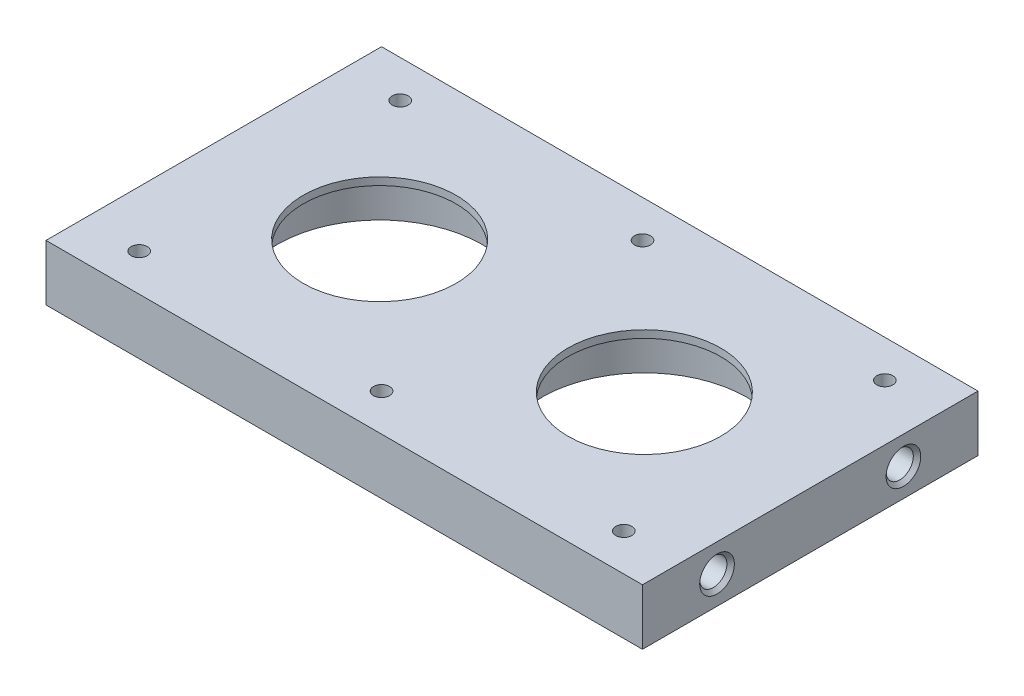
ISO-10303-21;
HEADER;
FILE_DESCRIPTION(('STEP AP214'),'2;1');
FILE_NAME('part.step','',(''),(''),'','','');
FILE_SCHEMA(('AUTOMOTIVE_DESIGN { 1 0 10303 214 1 1 1 1 }'));
ENDSEC;
DATA;
#1=APPLICATION_CONTEXT('core data for automotive mechanical design processes');
#2=APPLICATION_PROTOCOL_DEFINITION('international standard','automotive_design',2000,#1);
#3=PRODUCT_CONTEXT('',#1,'mechanical');
#4=PRODUCT('Part','Part','',(#3));
#5=PRODUCT_RELATED_PRODUCT_CATEGORY('part','',(#4));
#6=PRODUCT_DEFINITION_FORMATION('','',#4);
#7=PRODUCT_DEFINITION_CONTEXT('part definition',#1,'design');
#8=PRODUCT_DEFINITION('design','',#6,#7);
#9=PRODUCT_DEFINITION_SHAPE('','',#8);
#10=(LENGTH_UNIT() NAMED_UNIT(*) SI_UNIT(.MILLI.,.METRE.));
#11=(NAMED_UNIT(*) PLANE_ANGLE_UNIT() SI_UNIT($,.RADIAN.));
#12=(NAMED_UNIT(*) SI_UNIT($,.STERADIAN.) SOLID_ANGLE_UNIT());
#13=UNCERTAINTY_MEASURE_WITH_UNIT(LENGTH_MEASURE(1.E-05),#10,'distance_accuracy_value','');
#14=(GEOMETRIC_REPRESENTATION_CONTEXT(3) GLOBAL_UNCERTAINTY_ASSIGNED_CONTEXT((#13)) GLOBAL_UNIT_ASSIGNED_CONTEXT((#10,
#11,#12)) REPRESENTATION_CONTEXT('',''));
#15=CARTESIAN_POINT('',(0.,0.,0.));
#16=DIRECTION('',(0.,0.,1.));
#17=DIRECTION('',(1.,0.,0.));
#18=AXIS2_PLACEMENT_3D('',#15,#16,#17);
#19=CARTESIAN_POINT('',(0.,0.,0.));
#20=DIRECTION('',(0.,1.,0.));
#21=DIRECTION('',(0.,0.,1.));
#22=AXIS2_PLACEMENT_3D('',#19,#20,#21);
#23=PLANE('',#22);
#24=CARTESIAN_POINT('',(-145.,0.,-80.));
#25=DIRECTION('',(0.,-1.,0.));
#26=DIRECTION('',(0.,0.,1.));
#27=AXIS2_PLACEMENT_3D('',#24,#25,#26);
#28=CIRCLE('',#27,2.15000000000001);
#29=CARTESIAN_POINT('',(-145.,0.,-77.85));
#30=VERTEX_POINT('',#29);
#31=EDGE_CURVE('E319',#30,#30,#28,.T.);
#32=ORIENTED_EDGE('',*,*,#31,.F.);
#33=EDGE_LOOP('',(#32));
#34=FACE_BOUND('',#33,.T.);
#35=CARTESIAN_POINT('',(-80.,0.,-80.));
#36=DIRECTION('',(0.,-1.,0.));
#37=DIRECTION('',(0.,0.,1.));
#38=AXIS2_PLACEMENT_3D('',#35,#36,#37);
#39=CIRCLE('',#38,2.15);
#40=CARTESIAN_POINT('',(-80.,0.,-77.85));
#41=VERTEX_POINT('',#40);
#42=EDGE_CURVE('E311',#41,#41,#39,.T.);
#43=ORIENTED_EDGE('',*,*,#42,.F.);
#44=EDGE_LOOP('',(#43));
#45=FACE_BOUND('',#44,.T.);
#46=CARTESIAN_POINT('',(-15.,0.,-80.));
#47=DIRECTION('',(0.,-1.,0.));
#48=DIRECTION('',(0.,0.,1.));
#49=AXIS2_PLACEMENT_3D('',#46,#47,#48);
#50=CIRCLE('',#49,2.15);
#51=CARTESIAN_POINT('',(-15.,0.,-77.85));
#52=VERTEX_POINT('',#51);
#53=EDGE_CURVE('E303',#52,#52,#50,.T.);
#54=ORIENTED_EDGE('',*,*,#53,.F.);
#55=EDGE_LOOP('',(#54));
#56=FACE_BOUND('',#55,.T.);
#57=CARTESIAN_POINT('',(-15.,0.,-10.));
#58=DIRECTION('',(0.,-1.,0.));
#59=DIRECTION('',(0.,0.,-1.));
#60=AXIS2_PLACEMENT_3D('',#57,#58,#59);
#61=CIRCLE('',#60,2.15);
#62=CARTESIAN_POINT('',(-15.,0.,-12.15));
#63=VERTEX_POINT('',#62);
#64=EDGE_CURVE('E295',#63,#63,#61,.T.);
#65=ORIENTED_EDGE('',*,*,#64,.F.);
#66=EDGE_LOOP('',(#65));
#67=FACE_BOUND('',#66,.T.);
#68=CARTESIAN_POINT('',(-80.,0.,-10.));
#69=DIRECTION('',(0.,-1.,0.));
#70=DIRECTION('',(0.,0.,-1.));
#71=AXIS2_PLACEMENT_3D('',#68,#69,#70);
#72=CIRCLE('',#71,2.15);
#73=CARTESIAN_POINT('',(-80.,0.,-12.15));
#74=VERTEX_POINT('',#73);
#75=EDGE_CURVE('E287',#74,#74,#72,.T.);
#76=ORIENTED_EDGE('',*,*,#75,.F.);
#77=EDGE_LOOP('',(#76));
#78=FACE_BOUND('',#77,.T.);
#79=CARTESIAN_POINT('',(-145.,0.,-10.));
#80=DIRECTION('',(0.,-1.,0.));
#81=DIRECTION('',(0.,0.,-1.));
#82=AXIS2_PLACEMENT_3D('',#79,#80,#81);
#83=CIRCLE('',#82,2.15000000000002);
#84=CARTESIAN_POINT('',(-145.,0.,-12.15));
#85=VERTEX_POINT('',#84);
#86=EDGE_CURVE('E280',#85,#85,#83,.T.);
#87=ORIENTED_EDGE('',*,*,#86,.F.);
#88=EDGE_LOOP('',(#87));
#89=FACE_BOUND('',#88,.T.);
#90=CARTESIAN_POINT('',(-115.5,0.,-45.));
#91=DIRECTION('',(0.,1.,0.));
#92=DIRECTION('',(0.,0.,1.));
#93=AXIS2_PLACEMENT_3D('',#90,#91,#92);
#94=CIRCLE('',#93,27.55);
#95=CARTESIAN_POINT('',(-115.5,0.,-72.55));
#96=VERTEX_POINT('',#95);
#97=EDGE_CURVE('E127',#96,#96,#94,.T.);
#98=ORIENTED_EDGE('',*,*,#97,.T.);
#99=EDGE_LOOP('',(#98));
#100=FACE_BOUND('',#99,.T.);
#101=DIRECTION('',(0.,0.,-1.));
#102=VECTOR('',#101,1.);
#103=CARTESIAN_POINT('',(0.,0.,0.));
#104=LINE('',#103,#102);
#105=CARTESIAN_POINT('',(0.,0.,0.));
#106=VERTEX_POINT('',#105);
#107=CARTESIAN_POINT('',(0.,0.,-90.));
#108=VERTEX_POINT('',#107);
#109=EDGE_CURVE('E131',#106,#108,#104,.T.);
#110=ORIENTED_EDGE('',*,*,#109,.F.);
#111=DIRECTION('',(1.,0.,0.));
#112=VECTOR('',#111,1.);
#113=CARTESIAN_POINT('',(0.,0.,0.));
#114=LINE('',#113,#112);
#115=CARTESIAN_POINT('',(-160.,0.,0.));
#116=VERTEX_POINT('',#115);
#117=EDGE_CURVE('E52',#116,#106,#114,.T.);
#118=ORIENTED_EDGE('',*,*,#117,.F.);
#119=DIRECTION('',(0.,0.,1.));
#120=VECTOR('',#119,1.);
#121=CARTESIAN_POINT('',(-160.,0.,0.));
#122=LINE('',#121,#120);
#123=CARTESIAN_POINT('',(-160.,0.,-90.));
#124=VERTEX_POINT('',#123);
#125=EDGE_CURVE('E60',#124,#116,#122,.T.);
#126=ORIENTED_EDGE('',*,*,#125,.F.);
#127=DIRECTION('',(-1.,0.,0.));
#128=VECTOR('',#127,1.);
#129=CARTESIAN_POINT('',(0.,0.,-90.));
#130=LINE('',#129,#128);
#131=EDGE_CURVE('E135',#108,#124,#130,.T.);
#132=ORIENTED_EDGE('',*,*,#131,.F.);
#133=EDGE_LOOP('',(#110,#118,#126,#132));
#134=FACE_BOUND('',#133,.T.);
#135=CARTESIAN_POINT('',(-44.5,0.,-45.));
#136=DIRECTION('',(0.,1.,0.));
#137=DIRECTION('',(0.,0.,1.));
#138=AXIS2_PLACEMENT_3D('',#135,#136,#137);
#139=CIRCLE('',#138,27.55);
#140=CARTESIAN_POINT('',(-44.5,0.,-72.55));
#141=VERTEX_POINT('',#140);
#142=EDGE_CURVE('E123',#141,#141,#139,.T.);
#143=ORIENTED_EDGE('',*,*,#142,.T.);
#144=EDGE_LOOP('',(#143));
#145=FACE_BOUND('',#144,.T.);
#146=ADVANCED_FACE('F36',(#34,#45,#56,#67,#78,#89,#100,#134,#145),#23,.F.);
#147=CARTESIAN_POINT('',(0.,13.,0.));
#148=DIRECTION('',(-1.,0.,0.));
#149=DIRECTION('',(0.,0.,1.));
#150=AXIS2_PLACEMENT_3D('',#147,#148,#149);
#151=PLANE('',#150);
#152=CARTESIAN_POINT('',(0.,7.5,-20.));
#153=DIRECTION('',(-1.,0.,0.));
#154=DIRECTION('',(0.,0.,1.));
#155=AXIS2_PLACEMENT_3D('',#152,#153,#154);
#156=CIRCLE('',#155,4.65000000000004);
#157=CARTESIAN_POINT('',(0.,7.5,-15.35));
#158=VERTEX_POINT('',#157);
#159=EDGE_CURVE('E157',#158,#158,#156,.T.);
#160=ORIENTED_EDGE('',*,*,#159,.T.);
#161=EDGE_LOOP('',(#160));
#162=FACE_BOUND('',#161,.T.);
#163=CARTESIAN_POINT('',(0.,7.5,-70.));
#164=DIRECTION('',(-1.,0.,0.));
#165=DIRECTION('',(0.,0.,1.));
#166=AXIS2_PLACEMENT_3D('',#163,#164,#165);
#167=CIRCLE('',#166,4.65000000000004);
#168=CARTESIAN_POINT('',(0.,7.5,-65.3499999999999));
#169=VERTEX_POINT('',#168);
#170=EDGE_CURVE('E153',#169,#169,#167,.T.);
#171=ORIENTED_EDGE('',*,*,#170,.T.);
#172=EDGE_LOOP('',(#171));
#173=FACE_BOUND('',#172,.T.);
#174=ORIENTED_EDGE('',*,*,#109,.T.);
#175=DIRECTION('',(0.,-1.,0.));
#176=VECTOR('',#175,1.);
#177=CARTESIAN_POINT('',(0.,13.,-90.));
#178=LINE('',#177,#176);
#179=CARTESIAN_POINT('',(0.,15.,-90.));
#180=VERTEX_POINT('',#179);
#181=EDGE_CURVE('E145',#180,#108,#178,.T.);
#182=ORIENTED_EDGE('',*,*,#181,.F.);
#183=DIRECTION('',(0.,0.,-1.));
#184=VECTOR('',#183,1.);
#185=CARTESIAN_POINT('',(0.,15.,-90.));
#186=LINE('',#185,#184);
#187=CARTESIAN_POINT('',(0.,15.,0.));
#188=VERTEX_POINT('',#187);
#189=EDGE_CURVE('E93',#188,#180,#186,.T.);
#190=ORIENTED_EDGE('',*,*,#189,.F.);
#191=DIRECTION('',(0.,-1.,0.));
#192=VECTOR('',#191,1.);
#193=CARTESIAN_POINT('',(0.,13.,0.));
#194=LINE('',#193,#192);
#195=EDGE_CURVE('E84',#188,#106,#194,.T.);
#196=ORIENTED_EDGE('',*,*,#195,.T.);
#197=EDGE_LOOP('',(#174,#182,#190,#196));
#198=FACE_BOUND('',#197,.T.);
#199=ADVANCED_FACE('F232',(#162,#173,#198),#151,.F.);
#200=CARTESIAN_POINT('',(0.,13.,-90.));
#201=DIRECTION('',(0.,0.,1.));
#202=DIRECTION('',(1.,0.,0.));
#203=AXIS2_PLACEMENT_3D('',#200,#201,#202);
#204=PLANE('',#203);
#205=ORIENTED_EDGE('',*,*,#131,.T.);
#206=DIRECTION('',(0.,-1.,0.));
#207=VECTOR('',#206,1.);
#208=CARTESIAN_POINT('',(-160.,13.,-90.));
#209=LINE('',#208,#207);
#210=CARTESIAN_POINT('',(-160.,15.,-90.));
#211=VERTEX_POINT('',#210);
#212=EDGE_CURVE('E83',#211,#124,#209,.T.);
#213=ORIENTED_EDGE('',*,*,#212,.F.);
#214=DIRECTION('',(-1.,0.,0.));
#215=VECTOR('',#214,1.);
#216=CARTESIAN_POINT('',(-160.,15.,-90.));
#217=LINE('',#216,#215);
#218=EDGE_CURVE('E99',#180,#211,#217,.T.);
#219=ORIENTED_EDGE('',*,*,#218,.F.);
#220=ORIENTED_EDGE('',*,*,#181,.T.);
#221=EDGE_LOOP('',(#205,#213,#219,#220));
#222=FACE_BOUND('',#221,.T.);
#223=ADVANCED_FACE('F238',(#222),#204,.F.);
#224=CARTESIAN_POINT('',(-160.,13.,0.));
#225=DIRECTION('',(1.,0.,0.));
#226=DIRECTION('',(0.,0.,-1.));
#227=AXIS2_PLACEMENT_3D('',#224,#225,#226);
#228=PLANE('',#227);
#229=CARTESIAN_POINT('',(-160.,7.5,-20.));
#230=DIRECTION('',(1.,0.,0.));
#231=DIRECTION('',(0.,0.,-1.));
#232=AXIS2_PLACEMENT_3D('',#229,#230,#231);
#233=CIRCLE('',#232,4.64999999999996);
#234=CARTESIAN_POINT('',(-160.,7.5,-24.65));
#235=VERTEX_POINT('',#234);
#236=EDGE_CURVE('E45',#235,#235,#233,.T.);
#237=ORIENTED_EDGE('',*,*,#236,.T.);
#238=EDGE_LOOP('',(#237));
#239=FACE_BOUND('',#238,.T.);
#240=CARTESIAN_POINT('',(-160.,7.5,-70.));
#241=DIRECTION('',(1.,0.,0.));
#242=DIRECTION('',(0.,0.,-1.));
#243=AXIS2_PLACEMENT_3D('',#240,#241,#242);
#244=CIRCLE('',#243,4.64999999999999);
#245=CARTESIAN_POINT('',(-160.,7.5,-74.65));
#246=VERTEX_POINT('',#245);
#247=EDGE_CURVE('E169',#246,#246,#244,.T.);
#248=ORIENTED_EDGE('',*,*,#247,.T.);
#249=EDGE_LOOP('',(#248));
#250=FACE_BOUND('',#249,.T.);
#251=ORIENTED_EDGE('',*,*,#125,.T.);
#252=DIRECTION('',(0.,-1.,0.));
#253=VECTOR('',#252,1.);
#254=CARTESIAN_POINT('',(-160.,13.,0.));
#255=LINE('',#254,#253);
#256=CARTESIAN_POINT('',(-160.,15.,0.));
#257=VERTEX_POINT('',#256);
#258=EDGE_CURVE('E77',#257,#116,#255,.T.);
#259=ORIENTED_EDGE('',*,*,#258,.F.);
#260=DIRECTION('',(0.,0.,1.));
#261=VECTOR('',#260,1.);
#262=CARTESIAN_POINT('',(-160.,15.,-90.));
#263=LINE('',#262,#261);
#264=EDGE_CURVE('E81',#211,#257,#263,.T.);
#265=ORIENTED_EDGE('',*,*,#264,.F.);
#266=ORIENTED_EDGE('',*,*,#212,.T.);
#267=EDGE_LOOP('',(#251,#259,#265,#266));
#268=FACE_BOUND('',#267,.T.);
#269=ADVANCED_FACE('F79',(#239,#250,#268),#228,.F.);
#270=CARTESIAN_POINT('',(0.,13.,0.));
#271=DIRECTION('',(0.,0.,-1.));
#272=DIRECTION('',(-1.,0.,0.));
#273=AXIS2_PLACEMENT_3D('',#270,#271,#272);
#274=PLANE('',#273);
#275=ORIENTED_EDGE('',*,*,#117,.T.);
#276=ORIENTED_EDGE('',*,*,#195,.F.);
#277=DIRECTION('',(1.,0.,0.));
#278=VECTOR('',#277,1.);
#279=CARTESIAN_POINT('',(-160.,15.,0.));
#280=LINE('',#279,#278);
#281=EDGE_CURVE('E87',#257,#188,#280,.T.);
#282=ORIENTED_EDGE('',*,*,#281,.F.);
#283=ORIENTED_EDGE('',*,*,#258,.T.);
#284=EDGE_LOOP('',(#275,#276,#282,#283));
#285=FACE_BOUND('',#284,.T.);
#286=ADVANCED_FACE('F88',(#285),#274,.F.);
#287=CARTESIAN_POINT('',(-115.5,13.,-45.));
#288=DIRECTION('',(0.,-1.,0.));
#289=DIRECTION('',(0.,0.,-1.));
#290=AXIS2_PLACEMENT_3D('',#287,#288,#289);
#291=CYLINDRICAL_SURFACE('',#290,27.55);
#292=CARTESIAN_POINT('',(-115.5,13.,-45.));
#293=DIRECTION('',(0.,1.,0.));
#294=DIRECTION('',(0.,0.,1.));
#295=AXIS2_PLACEMENT_3D('',#292,#293,#294);
#296=CIRCLE('',#295,27.55);
#297=CARTESIAN_POINT('',(-115.5,13.,-72.55));
#298=VERTEX_POINT('',#297);
#299=EDGE_CURVE('E119',#298,#298,#296,.T.);
#300=CARTESIAN_POINT('',(-115.5,13.,-72.55));
#301=CARTESIAN_POINT('',(-115.5,12.8645833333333,-72.55));
#302=CARTESIAN_POINT('',(-115.5,12.7291666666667,-72.55));
#303=CARTESIAN_POINT('',(-115.5,12.4583333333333,-72.55));
#304=CARTESIAN_POINT('',(-115.5,12.3229166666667,-72.55));
#305=CARTESIAN_POINT('',(-115.5,12.0520833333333,-72.55));
#306=CARTESIAN_POINT('',(-115.5,11.9166666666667,-72.55));
#307=CARTESIAN_POINT('',(-115.5,11.6458333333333,-72.55));
#308=CARTESIAN_POINT('',(-115.5,11.5104166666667,-72.55));
#309=CARTESIAN_POINT('',(-115.5,11.2395833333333,-72.55));
#310=CARTESIAN_POINT('',(-115.5,11.1041666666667,-72.55));
#311=CARTESIAN_POINT('',(-115.5,10.8333333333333,-72.55));
#312=CARTESIAN_POINT('',(-115.5,10.6979166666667,-72.55));
#313=CARTESIAN_POINT('',(-115.5,10.4270833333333,-72.55));
#314=CARTESIAN_POINT('',(-115.5,10.2916666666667,-72.55));
#315=CARTESIAN_POINT('',(-115.5,10.0208333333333,-72.55));
#316=CARTESIAN_POINT('',(-115.5,9.88541666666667,-72.55));
#317=CARTESIAN_POINT('',(-115.5,9.61458333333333,-72.55));
#318=CARTESIAN_POINT('',(-115.5,9.47916666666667,-72.55));
#319=CARTESIAN_POINT('',(-115.5,9.20833333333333,-72.55));
#320=CARTESIAN_POINT('',(-115.5,9.07291666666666,-72.55));
#321=CARTESIAN_POINT('',(-115.5,8.80208333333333,-72.55));
#322=CARTESIAN_POINT('',(-115.5,8.66666666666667,-72.55));
#323=CARTESIAN_POINT('',(-115.5,8.39583333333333,-72.55));
#324=CARTESIAN_POINT('',(-115.5,8.26041666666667,-72.55));
#325=CARTESIAN_POINT('',(-115.5,7.98958333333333,-72.55));
#326=CARTESIAN_POINT('',(-115.5,7.85416666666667,-72.55));
#327=CARTESIAN_POINT('',(-115.5,7.58333333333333,-72.55));
#328=CARTESIAN_POINT('',(-115.5,7.44791666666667,-72.55));
#329=CARTESIAN_POINT('',(-115.5,7.17708333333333,-72.55));
#330=CARTESIAN_POINT('',(-115.5,7.04166666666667,-72.55));
#331=CARTESIAN_POINT('',(-115.5,6.77083333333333,-72.55));
#332=CARTESIAN_POINT('',(-115.5,6.63541666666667,-72.55));
#333=CARTESIAN_POINT('',(-115.5,6.36458333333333,-72.55));
#334=CARTESIAN_POINT('',(-115.5,6.22916666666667,-72.55));
#335=CARTESIAN_POINT('',(-115.5,5.95833333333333,-72.55));
#336=CARTESIAN_POINT('',(-115.5,5.82291666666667,-72.55));
#337=CARTESIAN_POINT('',(-115.5,5.55208333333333,-72.55));
#338=CARTESIAN_POINT('',(-115.5,5.41666666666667,-72.55));
#339=CARTESIAN_POINT('',(-115.5,5.14583333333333,-72.55));
#340=CARTESIAN_POINT('',(-115.5,5.01041666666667,-72.55));
#341=CARTESIAN_POINT('',(-115.5,4.73958333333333,-72.55));
#342=CARTESIAN_POINT('',(-115.5,4.60416666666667,-72.55));
#343=CARTESIAN_POINT('',(-115.5,4.33333333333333,-72.55));
#344=CARTESIAN_POINT('',(-115.5,4.19791666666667,-72.55));
#345=CARTESIAN_POINT('',(-115.5,3.92708333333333,-72.55));
#346=CARTESIAN_POINT('',(-115.5,3.79166666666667,-72.55));
#347=CARTESIAN_POINT('',(-115.5,3.52083333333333,-72.55));
#348=CARTESIAN_POINT('',(-115.5,3.38541666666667,-72.55));
#349=CARTESIAN_POINT('',(-115.5,3.11458333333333,-72.55));
#350=CARTESIAN_POINT('',(-115.5,2.97916666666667,-72.55));
#351=CARTESIAN_POINT('',(-115.5,2.70833333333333,-72.55));
#352=CARTESIAN_POINT('',(-115.5,2.57291666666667,-72.55));
#353=CARTESIAN_POINT('',(-115.5,2.30208333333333,-72.55));
#354=CARTESIAN_POINT('',(-115.5,2.16666666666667,-72.55));
#355=CARTESIAN_POINT('',(-115.5,1.89583333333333,-72.55));
#356=CARTESIAN_POINT('',(-115.5,1.76041666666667,-72.55));
#357=CARTESIAN_POINT('',(-115.5,1.48958333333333,-72.55));
#358=CARTESIAN_POINT('',(-115.5,1.35416666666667,-72.55));
#359=CARTESIAN_POINT('',(-115.5,1.08333333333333,-72.55));
#360=CARTESIAN_POINT('',(-115.5,0.947916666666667,-72.55));
#361=CARTESIAN_POINT('',(-115.5,0.677083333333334,-72.55));
#362=CARTESIAN_POINT('',(-115.5,0.541666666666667,-72.55));
#363=CARTESIAN_POINT('',(-115.5,0.270833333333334,-72.55));
#364=CARTESIAN_POINT('',(-115.5,0.135416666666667,-72.55));
#365=CARTESIAN_POINT('',(-115.5,0.,-72.55));
#366=B_SPLINE_CURVE_WITH_KNOTS('',3,(#300,#301,#302,#303,#304,#305,#306,#307,#308,#309,#310,
#311,#312,#313,#314,#315,#316,#317,#318,#319,#320,#321,#322,#323,#324,#325,#326,#327,#328,#329,
#330,#331,#332,#333,#334,#335,#336,#337,#338,#339,#340,#341,#342,#343,#344,#345,#346,#347,#348,
#349,#350,#351,#352,#353,#354,#355,#356,#357,#358,#359,#360,#361,#362,#363,#364,#365),
.UNSPECIFIED.,.F.,.F.,(4,2,2,2,2,2,2,2,2,2,2,2,2,2,2,2,2,2,2,2,2,2,2,2,2,2,2,2,2,2,2,2,4),(0.,
0.40625,0.812500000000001,1.21875,1.625,2.03125,2.4375,2.84375,3.25,3.65625,4.0625,4.46875,
4.875,5.28125,5.6875,6.09375,6.5,6.90625,7.3125,7.71875,8.125,8.53125,8.9375,9.34375,9.75,
10.15625,10.5625,10.96875,11.375,11.78125,12.1875,12.59375,13.),.UNSPECIFIED.);
#367=EDGE_CURVE('BSEAM245',#298,#96,#366,.T.);
#368=ORIENTED_EDGE('',*,*,#299,.T.);
#369=ORIENTED_EDGE('',*,*,#97,.F.);
#370=ORIENTED_EDGE('',*,*,#367,.T.);
#371=ORIENTED_EDGE('',*,*,#367,.F.);
#372=EDGE_LOOP('',(#368,#370,#369,#371));
#373=FACE_BOUND('',#372,.T.);
#374=ADVANCED_FACE('F245',(#373),#291,.F.);
#375=CARTESIAN_POINT('',(-44.5,13.,-45.));
#376=DIRECTION('',(0.,-1.,0.));
#377=DIRECTION('',(0.,0.,-1.));
#378=AXIS2_PLACEMENT_3D('',#375,#376,#377);
#379=CYLINDRICAL_SURFACE('',#378,27.55);
#380=CARTESIAN_POINT('',(-44.5,13.,-45.));
#381=DIRECTION('',(0.,1.,0.));
#382=DIRECTION('',(0.,0.,1.));
#383=AXIS2_PLACEMENT_3D('',#380,#381,#382);
#384=CIRCLE('',#383,27.55);
#385=CARTESIAN_POINT('',(-44.5,13.,-72.55));
#386=VERTEX_POINT('',#385);
#387=EDGE_CURVE('E115',#386,#386,#384,.T.);
#388=CARTESIAN_POINT('',(-44.5,13.,-72.55));
#389=CARTESIAN_POINT('',(-44.5,12.8645833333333,-72.55));
#390=CARTESIAN_POINT('',(-44.5,12.7291666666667,-72.55));
#391=CARTESIAN_POINT('',(-44.5,12.4583333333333,-72.55));
#392=CARTESIAN_POINT('',(-44.5,12.3229166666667,-72.55));
#393=CARTESIAN_POINT('',(-44.5,12.0520833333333,-72.55));
#394=CARTESIAN_POINT('',(-44.5,11.9166666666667,-72.55));
#395=CARTESIAN_POINT('',(-44.5,11.6458333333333,-72.55));
#396=CARTESIAN_POINT('',(-44.5,11.5104166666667,-72.55));
#397=CARTESIAN_POINT('',(-44.5,11.2395833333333,-72.55));
#398=CARTESIAN_POINT('',(-44.5,11.1041666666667,-72.55));
#399=CARTESIAN_POINT('',(-44.5,10.8333333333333,-72.55));
#400=CARTESIAN_POINT('',(-44.5,10.6979166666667,-72.55));
#401=CARTESIAN_POINT('',(-44.5,10.4270833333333,-72.55));
#402=CARTESIAN_POINT('',(-44.5,10.2916666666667,-72.55));
#403=CARTESIAN_POINT('',(-44.5,10.0208333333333,-72.55));
#404=CARTESIAN_POINT('',(-44.5,9.88541666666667,-72.55));
#405=CARTESIAN_POINT('',(-44.5,9.61458333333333,-72.55));
#406=CARTESIAN_POINT('',(-44.5,9.47916666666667,-72.55));
#407=CARTESIAN_POINT('',(-44.5,9.20833333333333,-72.55));
#408=CARTESIAN_POINT('',(-44.5,9.07291666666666,-72.55));
#409=CARTESIAN_POINT('',(-44.5,8.80208333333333,-72.55));
#410=CARTESIAN_POINT('',(-44.5,8.66666666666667,-72.55));
#411=CARTESIAN_POINT('',(-44.5,8.39583333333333,-72.55));
#412=CARTESIAN_POINT('',(-44.5,8.26041666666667,-72.55));
#413=CARTESIAN_POINT('',(-44.5,7.98958333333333,-72.55));
#414=CARTESIAN_POINT('',(-44.5,7.85416666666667,-72.55));
#415=CARTESIAN_POINT('',(-44.5,7.58333333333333,-72.55));
#416=CARTESIAN_POINT('',(-44.5,7.44791666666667,-72.55));
#417=CARTESIAN_POINT('',(-44.5,7.17708333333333,-72.55));
#418=CARTESIAN_POINT('',(-44.5,7.04166666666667,-72.55));
#419=CARTESIAN_POINT('',(-44.5,6.77083333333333,-72.55));
#420=CARTESIAN_POINT('',(-44.5,6.63541666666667,-72.55));
#421=CARTESIAN_POINT('',(-44.5,6.36458333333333,-72.55));
#422=CARTESIAN_POINT('',(-44.5,6.22916666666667,-72.55));
#423=CARTESIAN_POINT('',(-44.5,5.95833333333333,-72.55));
#424=CARTESIAN_POINT('',(-44.5,5.82291666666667,-72.55));
#425=CARTESIAN_POINT('',(-44.5,5.55208333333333,-72.55));
#426=CARTESIAN_POINT('',(-44.5,5.41666666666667,-72.55));
#427=CARTESIAN_POINT('',(-44.5,5.14583333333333,-72.55));
#428=CARTESIAN_POINT('',(-44.5,5.01041666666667,-72.55));
#429=CARTESIAN_POINT('',(-44.5,4.73958333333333,-72.55));
#430=CARTESIAN_POINT('',(-44.5,4.60416666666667,-72.55));
#431=CARTESIAN_POINT('',(-44.5,4.33333333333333,-72.55));
#432=CARTESIAN_POINT('',(-44.5,4.19791666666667,-72.55));
#433=CARTESIAN_POINT('',(-44.5,3.92708333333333,-72.55));
#434=CARTESIAN_POINT('',(-44.5,3.79166666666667,-72.55));
#435=CARTESIAN_POINT('',(-44.5,3.52083333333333,-72.55));
#436=CARTESIAN_POINT('',(-44.5,3.38541666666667,-72.55));
#437=CARTESIAN_POINT('',(-44.5,3.11458333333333,-72.55));
#438=CARTESIAN_POINT('',(-44.5,2.97916666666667,-72.55));
#439=CARTESIAN_POINT('',(-44.5,2.70833333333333,-72.55));
#440=CARTESIAN_POINT('',(-44.5,2.57291666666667,-72.55));
#441=CARTESIAN_POINT('',(-44.5,2.30208333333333,-72.55));
#442=CARTESIAN_POINT('',(-44.5,2.16666666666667,-72.55));
#443=CARTESIAN_POINT('',(-44.5,1.89583333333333,-72.55));
#444=CARTESIAN_POINT('',(-44.5,1.76041666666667,-72.55));
#445=CARTESIAN_POINT('',(-44.5,1.48958333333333,-72.55));
#446=CARTESIAN_POINT('',(-44.5,1.35416666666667,-72.55));
#447=CARTESIAN_POINT('',(-44.5,1.08333333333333,-72.55));
#448=CARTESIAN_POINT('',(-44.5,0.947916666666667,-72.55));
#449=CARTESIAN_POINT('',(-44.5,0.677083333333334,-72.55));
#450=CARTESIAN_POINT('',(-44.5,0.541666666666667,-72.55));
#451=CARTESIAN_POINT('',(-44.5,0.270833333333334,-72.55));
#452=CARTESIAN_POINT('',(-44.5,0.135416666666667,-72.55));
#453=CARTESIAN_POINT('',(-44.5,0.,-72.55));
#454=B_SPLINE_CURVE_WITH_KNOTS('',3,(#388,#389,#390,#391,#392,#393,#394,#395,#396,#397,#398,
#399,#400,#401,#402,#403,#404,#405,#406,#407,#408,#409,#410,#411,#412,#413,#414,#415,#416,#417,
#418,#419,#420,#421,#422,#423,#424,#425,#426,#427,#428,#429,#430,#431,#432,#433,#434,#435,#436,
#437,#438,#439,#440,#441,#442,#443,#444,#445,#446,#447,#448,#449,#450,#451,#452,#453),
.UNSPECIFIED.,.F.,.F.,(4,2,2,2,2,2,2,2,2,2,2,2,2,2,2,2,2,2,2,2,2,2,2,2,2,2,2,2,2,2,2,2,4),(0.,
0.40625,0.812500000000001,1.21875,1.625,2.03125,2.4375,2.84375,3.25,3.65625,4.0625,4.46875,
4.875,5.28125,5.6875,6.09375,6.5,6.90625,7.3125,7.71875,8.125,8.53125,8.9375,9.34375,9.75,
10.15625,10.5625,10.96875,11.375,11.78125,12.1875,12.59375,13.),.UNSPECIFIED.);
#455=EDGE_CURVE('BSEAM533',#386,#141,#454,.T.);
#456=ORIENTED_EDGE('',*,*,#387,.T.);
#457=ORIENTED_EDGE('',*,*,#142,.F.);
#458=ORIENTED_EDGE('',*,*,#455,.T.);
#459=ORIENTED_EDGE('',*,*,#455,.F.);
#460=EDGE_LOOP('',(#456,#458,#457,#459));
#461=FACE_BOUND('',#460,.T.);
#462=ADVANCED_FACE('F533',(#461),#379,.F.);
#463=CARTESIAN_POINT('',(0.,13.,0.));
#464=DIRECTION('',(0.,1.,0.));
#465=DIRECTION('',(0.,0.,1.));
#466=AXIS2_PLACEMENT_3D('',#463,#464,#465);
#467=PLANE('',#466);
#468=ORIENTED_EDGE('',*,*,#299,.F.);
#469=EDGE_LOOP('',(#468));
#470=FACE_BOUND('',#469,.T.);
#471=CARTESIAN_POINT('',(-115.5,13.,-45.));
#472=DIRECTION('',(0.,1.,0.));
#473=DIRECTION('',(0.,0.,1.));
#474=AXIS2_PLACEMENT_3D('',#471,#472,#473);
#475=CIRCLE('',#474,20.5);
#476=CARTESIAN_POINT('',(-115.5,13.,-24.5));
#477=VERTEX_POINT('',#476);
#478=EDGE_CURVE('E107',#477,#477,#475,.T.);
#479=ORIENTED_EDGE('',*,*,#478,.T.);
#480=EDGE_LOOP('',(#479));
#481=FACE_BOUND('',#480,.T.);
#482=ADVANCED_FACE('F518',(#470,#481),#467,.F.);
#483=CARTESIAN_POINT('',(0.,15.,0.));
#484=DIRECTION('',(0.,1.,0.));
#485=DIRECTION('',(0.,0.,1.));
#486=AXIS2_PLACEMENT_3D('',#483,#484,#485);
#487=PLANE('',#486);
#488=CARTESIAN_POINT('',(-145.,15.,-80.));
#489=DIRECTION('',(0.,-1.,0.));
#490=DIRECTION('',(0.,0.,1.));
#491=AXIS2_PLACEMENT_3D('',#488,#489,#490);
#492=CIRCLE('',#491,2.15000000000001);
#493=CARTESIAN_POINT('',(-145.,15.,-77.85));
#494=VERTEX_POINT('',#493);
#495=EDGE_CURVE('E315',#494,#494,#492,.T.);
#496=ORIENTED_EDGE('',*,*,#495,.T.);
#497=EDGE_LOOP('',(#496));
#498=FACE_BOUND('',#497,.T.);
#499=CARTESIAN_POINT('',(-80.,15.,-80.));
#500=DIRECTION('',(0.,-1.,0.));
#501=DIRECTION('',(0.,0.,1.));
#502=AXIS2_PLACEMENT_3D('',#499,#500,#501);
#503=CIRCLE('',#502,2.15);
#504=CARTESIAN_POINT('',(-80.,15.,-77.85));
#505=VERTEX_POINT('',#504);
#506=EDGE_CURVE('E307',#505,#505,#503,.T.);
#507=ORIENTED_EDGE('',*,*,#506,.T.);
#508=EDGE_LOOP('',(#507));
#509=FACE_BOUND('',#508,.T.);
#510=CARTESIAN_POINT('',(-15.,15.,-80.));
#511=DIRECTION('',(0.,-1.,0.));
#512=DIRECTION('',(0.,0.,1.));
#513=AXIS2_PLACEMENT_3D('',#510,#511,#512);
#514=CIRCLE('',#513,2.15);
#515=CARTESIAN_POINT('',(-15.,15.,-77.85));
#516=VERTEX_POINT('',#515);
#517=EDGE_CURVE('E299',#516,#516,#514,.T.);
#518=ORIENTED_EDGE('',*,*,#517,.T.);
#519=EDGE_LOOP('',(#518));
#520=FACE_BOUND('',#519,.T.);
#521=CARTESIAN_POINT('',(-15.,15.,-10.));
#522=DIRECTION('',(0.,-1.,0.));
#523=DIRECTION('',(0.,0.,-1.));
#524=AXIS2_PLACEMENT_3D('',#521,#522,#523);
#525=CIRCLE('',#524,2.15);
#526=CARTESIAN_POINT('',(-15.,15.,-12.15));
#527=VERTEX_POINT('',#526);
#528=EDGE_CURVE('E291',#527,#527,#525,.T.);
#529=ORIENTED_EDGE('',*,*,#528,.T.);
#530=EDGE_LOOP('',(#529));
#531=FACE_BOUND('',#530,.T.);
#532=CARTESIAN_POINT('',(-80.,15.,-10.));
#533=DIRECTION('',(0.,-1.,0.));
#534=DIRECTION('',(0.,0.,-1.));
#535=AXIS2_PLACEMENT_3D('',#532,#533,#534);
#536=CIRCLE('',#535,2.15);
#537=CARTESIAN_POINT('',(-80.,15.,-12.15));
#538=VERTEX_POINT('',#537);
#539=EDGE_CURVE('E285',#538,#538,#536,.T.);
#540=ORIENTED_EDGE('',*,*,#539,.T.);
#541=EDGE_LOOP('',(#540));
#542=FACE_BOUND('',#541,.T.);
#543=CARTESIAN_POINT('',(-145.,15.,-10.));
#544=DIRECTION('',(0.,-1.,0.));
#545=DIRECTION('',(0.,0.,-1.));
#546=AXIS2_PLACEMENT_3D('',#543,#544,#545);
#547=CIRCLE('',#546,2.15000000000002);
#548=CARTESIAN_POINT('',(-145.,15.,-12.15));
#549=VERTEX_POINT('',#548);
#550=EDGE_CURVE('E276',#549,#549,#547,.T.);
#551=ORIENTED_EDGE('',*,*,#550,.T.);
#552=EDGE_LOOP('',(#551));
#553=FACE_BOUND('',#552,.T.);
#554=CARTESIAN_POINT('',(-115.5,15.,-45.));
#555=DIRECTION('',(0.,1.,0.));
#556=DIRECTION('',(0.,0.,1.));
#557=AXIS2_PLACEMENT_3D('',#554,#555,#556);
#558=CIRCLE('',#557,20.5);
#559=CARTESIAN_POINT('',(-115.5,15.,-24.5));
#560=VERTEX_POINT('',#559);
#561=EDGE_CURVE('E101',#560,#560,#558,.T.);
#562=ORIENTED_EDGE('',*,*,#561,.F.);
#563=EDGE_LOOP('',(#562));
#564=FACE_BOUND('',#563,.T.);
#565=ORIENTED_EDGE('',*,*,#264,.T.);
#566=ORIENTED_EDGE('',*,*,#281,.T.);
#567=ORIENTED_EDGE('',*,*,#189,.T.);
#568=ORIENTED_EDGE('',*,*,#218,.T.);
#569=EDGE_LOOP('',(#565,#566,#567,#568));
#570=FACE_BOUND('',#569,.T.);
#571=CARTESIAN_POINT('',(-44.5,15.,-45.));
#572=DIRECTION('',(0.,1.,0.));
#573=DIRECTION('',(0.,0.,1.));
#574=AXIS2_PLACEMENT_3D('',#571,#572,#573);
#575=CIRCLE('',#574,20.5);
#576=CARTESIAN_POINT('',(-44.5,15.,-24.5));
#577=VERTEX_POINT('',#576);
#578=EDGE_CURVE('E207',#577,#577,#575,.T.);
#579=ORIENTED_EDGE('',*,*,#578,.F.);
#580=EDGE_LOOP('',(#579));
#581=FACE_BOUND('',#580,.T.);
#582=ADVANCED_FACE('F96',(#498,#509,#520,#531,#542,#553,#564,#570,#581),#487,.T.);
#583=ORIENTED_EDGE('',*,*,#387,.F.);
#584=EDGE_LOOP('',(#583));
#585=FACE_BOUND('',#584,.T.);
#586=CARTESIAN_POINT('',(-44.5,13.,-45.));
#587=DIRECTION('',(0.,1.,0.));
#588=DIRECTION('',(0.,0.,1.));
#589=AXIS2_PLACEMENT_3D('',#586,#587,#588);
#590=CIRCLE('',#589,20.5);
#591=CARTESIAN_POINT('',(-44.5,13.,-24.5));
#592=VERTEX_POINT('',#591);
#593=EDGE_CURVE('E199',#592,#592,#590,.T.);
#594=ORIENTED_EDGE('',*,*,#593,.T.);
#595=EDGE_LOOP('',(#594));
#596=FACE_BOUND('',#595,.T.);
#597=ADVANCED_FACE('F215',(#585,#596),#467,.F.);
#598=CARTESIAN_POINT('',(-115.5,15.,-45.));
#599=DIRECTION('',(0.,-1.,0.));
#600=DIRECTION('',(0.,0.,-1.));
#601=AXIS2_PLACEMENT_3D('',#598,#599,#600);
#602=CYLINDRICAL_SURFACE('',#601,20.5);
#603=ORIENTED_EDGE('',*,*,#561,.T.);
#604=EDGE_LOOP('',(#603));
#605=FACE_BOUND('',#604,.T.);
#606=ORIENTED_EDGE('',*,*,#478,.F.);
#607=EDGE_LOOP('',(#606));
#608=FACE_BOUND('',#607,.T.);
#609=ADVANCED_FACE('F220',(#605,#608),#602,.F.);
#610=CARTESIAN_POINT('',(-44.5,15.,-45.));
#611=DIRECTION('',(0.,-1.,0.));
#612=DIRECTION('',(0.,0.,-1.));
#613=AXIS2_PLACEMENT_3D('',#610,#611,#612);
#614=CYLINDRICAL_SURFACE('',#613,20.5);
#615=ORIENTED_EDGE('',*,*,#578,.T.);
#616=EDGE_LOOP('',(#615));
#617=FACE_BOUND('',#616,.T.);
#618=ORIENTED_EDGE('',*,*,#593,.F.);
#619=EDGE_LOOP('',(#618));
#620=FACE_BOUND('',#619,.T.);
#621=ADVANCED_FACE('F217',(#617,#620),#614,.F.);
#622=CARTESIAN_POINT('',(-140.,7.5,-70.));
#623=DIRECTION('',(-1.,0.,0.));
#624=DIRECTION('',(0.,0.,1.));
#625=AXIS2_PLACEMENT_3D('',#622,#623,#624);
#626=CYLINDRICAL_SURFACE('',#625,3.65);
#627=CARTESIAN_POINT('',(-159.,7.5,-70.));
#628=DIRECTION('',(1.,0.,0.));
#629=DIRECTION('',(0.,0.,-1.));
#630=AXIS2_PLACEMENT_3D('',#627,#628,#629);
#631=CIRCLE('',#630,3.65);
#632=CARTESIAN_POINT('',(-159.,7.5,-73.65));
#633=VERTEX_POINT('',#632);
#634=EDGE_CURVE('E11',#633,#633,#631,.F.);
#635=ORIENTED_EDGE('',*,*,#634,.T.);
#636=EDGE_LOOP('',(#635));
#637=FACE_BOUND('',#636,.T.);
#638=CARTESIAN_POINT('',(-140.,7.5,-70.));
#639=DIRECTION('',(-1.,0.,0.));
#640=DIRECTION('',(0.,0.,1.));
#641=AXIS2_PLACEMENT_3D('',#638,#639,#640);
#642=CIRCLE('',#641,3.65);
#643=CARTESIAN_POINT('',(-140.,7.5,-66.35));
#644=VERTEX_POINT('',#643);
#645=EDGE_CURVE('E195',#644,#644,#642,.T.);
#646=ORIENTED_EDGE('',*,*,#645,.F.);
#647=EDGE_LOOP('',(#646));
#648=FACE_BOUND('',#647,.T.);
#649=ADVANCED_FACE('F219',(#637,#648),#626,.F.);
#650=CARTESIAN_POINT('',(-140.,7.5,-70.));
#651=DIRECTION('',(-1.,0.,0.));
#652=DIRECTION('',(0.,0.,1.));
#653=AXIS2_PLACEMENT_3D('',#650,#651,#652);
#654=PLANE('',#653);
#655=ORIENTED_EDGE('',*,*,#645,.T.);
#656=EDGE_LOOP('',(#655));
#657=FACE_BOUND('',#656,.T.);
#658=ADVANCED_FACE('F189',(#657),#654,.T.);
#659=CARTESIAN_POINT('',(-140.,7.5,-20.));
#660=DIRECTION('',(-1.,0.,0.));
#661=DIRECTION('',(0.,0.,1.));
#662=AXIS2_PLACEMENT_3D('',#659,#660,#661);
#663=CYLINDRICAL_SURFACE('',#662,3.65);
#664=CARTESIAN_POINT('',(-159.,7.5,-20.));
#665=DIRECTION('',(1.,0.,0.));
#666=DIRECTION('',(0.,0.,-1.));
#667=AXIS2_PLACEMENT_3D('',#664,#665,#666);
#668=CIRCLE('',#667,3.65);
#669=CARTESIAN_POINT('',(-159.,7.5,-23.65));
#670=VERTEX_POINT('',#669);
#671=EDGE_CURVE('E165',#670,#670,#668,.F.);
#672=ORIENTED_EDGE('',*,*,#671,.T.);
#673=EDGE_LOOP('',(#672));
#674=FACE_BOUND('',#673,.T.);
#675=CARTESIAN_POINT('',(-140.,7.5,-20.));
#676=DIRECTION('',(-1.,0.,0.));
#677=DIRECTION('',(0.,0.,1.));
#678=AXIS2_PLACEMENT_3D('',#675,#676,#677);
#679=CIRCLE('',#678,3.65);
#680=CARTESIAN_POINT('',(-140.,7.5,-16.35));
#681=VERTEX_POINT('',#680);
#682=EDGE_CURVE('E193',#681,#681,#679,.T.);
#683=ORIENTED_EDGE('',*,*,#682,.F.);
#684=EDGE_LOOP('',(#683));
#685=FACE_BOUND('',#684,.T.);
#686=ADVANCED_FACE('F185',(#674,#685),#663,.F.);
#687=CARTESIAN_POINT('',(-140.,7.5,-20.));
#688=DIRECTION('',(-1.,0.,0.));
#689=DIRECTION('',(0.,0.,1.));
#690=AXIS2_PLACEMENT_3D('',#687,#688,#689);
#691=PLANE('',#690);
#692=ORIENTED_EDGE('',*,*,#682,.T.);
#693=EDGE_LOOP('',(#692));
#694=FACE_BOUND('',#693,.T.);
#695=ADVANCED_FACE('F188',(#694),#691,.T.);
#696=CARTESIAN_POINT('',(-20.,7.5,-20.));
#697=DIRECTION('',(1.,0.,0.));
#698=DIRECTION('',(0.,0.,-1.));
#699=AXIS2_PLACEMENT_3D('',#696,#697,#698);
#700=CYLINDRICAL_SURFACE('',#699,3.65);
#701=CARTESIAN_POINT('',(-1.00000000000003,7.5,-20.));
#702=DIRECTION('',(-1.,0.,0.));
#703=DIRECTION('',(0.,0.,1.));
#704=AXIS2_PLACEMENT_3D('',#701,#702,#703);
#705=CIRCLE('',#704,3.65);
#706=CARTESIAN_POINT('',(-1.00000000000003,7.5,-16.35));
#707=VERTEX_POINT('',#706);
#708=EDGE_CURVE('E149',#707,#707,#705,.F.);
#709=ORIENTED_EDGE('',*,*,#708,.T.);
#710=EDGE_LOOP('',(#709));
#711=FACE_BOUND('',#710,.T.);
#712=CARTESIAN_POINT('',(-20.,7.5,-20.));
#713=DIRECTION('',(1.,0.,0.));
#714=DIRECTION('',(0.,0.,-1.));
#715=AXIS2_PLACEMENT_3D('',#712,#713,#714);
#716=CIRCLE('',#715,3.65);
#717=CARTESIAN_POINT('',(-20.,7.5,-23.65));
#718=VERTEX_POINT('',#717);
#719=EDGE_CURVE('E196',#718,#718,#716,.T.);
#720=ORIENTED_EDGE('',*,*,#719,.F.);
#721=EDGE_LOOP('',(#720));
#722=FACE_BOUND('',#721,.T.);
#723=ADVANCED_FACE('F360',(#711,#722),#700,.F.);
#724=CARTESIAN_POINT('',(-20.,7.5,-20.));
#725=DIRECTION('',(1.,0.,0.));
#726=DIRECTION('',(0.,0.,-1.));
#727=AXIS2_PLACEMENT_3D('',#724,#725,#726);
#728=PLANE('',#727);
#729=ORIENTED_EDGE('',*,*,#719,.T.);
#730=EDGE_LOOP('',(#729));
#731=FACE_BOUND('',#730,.T.);
#732=ADVANCED_FACE('F270',(#731),#728,.T.);
#733=CARTESIAN_POINT('',(-20.,7.5,-70.));
#734=DIRECTION('',(1.,0.,0.));
#735=DIRECTION('',(0.,0.,-1.));
#736=AXIS2_PLACEMENT_3D('',#733,#734,#735);
#737=CYLINDRICAL_SURFACE('',#736,3.65);
#738=CARTESIAN_POINT('',(-1.00000000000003,7.5,-70.));
#739=DIRECTION('',(-1.,0.,0.));
#740=DIRECTION('',(0.,0.,1.));
#741=AXIS2_PLACEMENT_3D('',#738,#739,#740);
#742=CIRCLE('',#741,3.65);
#743=CARTESIAN_POINT('',(-1.00000000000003,7.5,-66.35));
#744=VERTEX_POINT('',#743);
#745=EDGE_CURVE('E161',#744,#744,#742,.F.);
#746=ORIENTED_EDGE('',*,*,#745,.T.);
#747=EDGE_LOOP('',(#746));
#748=FACE_BOUND('',#747,.T.);
#749=CARTESIAN_POINT('',(-20.,7.5,-70.));
#750=DIRECTION('',(1.,0.,0.));
#751=DIRECTION('',(0.,0.,-1.));
#752=AXIS2_PLACEMENT_3D('',#749,#750,#751);
#753=CIRCLE('',#752,3.65);
#754=CARTESIAN_POINT('',(-20.,7.5,-73.65));
#755=VERTEX_POINT('',#754);
#756=EDGE_CURVE('E203',#755,#755,#753,.T.);
#757=ORIENTED_EDGE('',*,*,#756,.F.);
#758=EDGE_LOOP('',(#757));
#759=FACE_BOUND('',#758,.T.);
#760=ADVANCED_FACE('F267',(#748,#759),#737,.F.);
#761=CARTESIAN_POINT('',(-20.,7.5,-70.));
#762=DIRECTION('',(1.,0.,0.));
#763=DIRECTION('',(0.,0.,-1.));
#764=AXIS2_PLACEMENT_3D('',#761,#762,#763);
#765=PLANE('',#764);
#766=ORIENTED_EDGE('',*,*,#756,.T.);
#767=EDGE_LOOP('',(#766));
#768=FACE_BOUND('',#767,.T.);
#769=ADVANCED_FACE('F257',(#768),#765,.T.);
#770=CARTESIAN_POINT('',(-1.00000000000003,7.5,-20.));
#771=DIRECTION('',(1.,0.,0.));
#772=DIRECTION('',(0.,0.,-1.));
#773=AXIS2_PLACEMENT_3D('',#770,#771,#772);
#774=CONICAL_SURFACE('',#773,3.65,0.785398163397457);
#775=ORIENTED_EDGE('',*,*,#159,.F.);
#776=EDGE_LOOP('',(#775));
#777=FACE_BOUND('',#776,.T.);
#778=ORIENTED_EDGE('',*,*,#708,.F.);
#779=EDGE_LOOP('',(#778));
#780=FACE_BOUND('',#779,.T.);
#781=ADVANCED_FACE('F254',(#777,#780),#774,.F.);
#782=CARTESIAN_POINT('',(-1.00000000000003,7.5,-70.));
#783=DIRECTION('',(1.,0.,0.));
#784=DIRECTION('',(0.,0.,-1.));
#785=AXIS2_PLACEMENT_3D('',#782,#783,#784);
#786=CONICAL_SURFACE('',#785,3.65,0.785398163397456);
#787=ORIENTED_EDGE('',*,*,#170,.F.);
#788=EDGE_LOOP('',(#787));
#789=FACE_BOUND('',#788,.T.);
#790=ORIENTED_EDGE('',*,*,#745,.F.);
#791=EDGE_LOOP('',(#790));
#792=FACE_BOUND('',#791,.T.);
#793=ADVANCED_FACE('F182',(#789,#792),#786,.F.);
#794=CARTESIAN_POINT('',(-159.,7.5,-20.));
#795=DIRECTION('',(-1.,0.,0.));
#796=DIRECTION('',(0.,0.,1.));
#797=AXIS2_PLACEMENT_3D('',#794,#795,#796);
#798=CONICAL_SURFACE('',#797,3.65,0.785398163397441);
#799=ORIENTED_EDGE('',*,*,#236,.F.);
#800=EDGE_LOOP('',(#799));
#801=FACE_BOUND('',#800,.T.);
#802=ORIENTED_EDGE('',*,*,#671,.F.);
#803=EDGE_LOOP('',(#802));
#804=FACE_BOUND('',#803,.T.);
#805=ADVANCED_FACE('F179',(#801,#804),#798,.F.);
#806=CARTESIAN_POINT('',(-159.,7.5,-70.));
#807=DIRECTION('',(-1.,0.,0.));
#808=DIRECTION('',(0.,0.,1.));
#809=AXIS2_PLACEMENT_3D('',#806,#807,#808);
#810=CONICAL_SURFACE('',#809,3.65,0.785398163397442);
#811=ORIENTED_EDGE('',*,*,#247,.F.);
#812=EDGE_LOOP('',(#811));
#813=FACE_BOUND('',#812,.T.);
#814=ORIENTED_EDGE('',*,*,#634,.F.);
#815=EDGE_LOOP('',(#814));
#816=FACE_BOUND('',#815,.T.);
#817=ADVANCED_FACE('F38',(#813,#816),#810,.F.);
#818=CARTESIAN_POINT('',(-145.,15.,-10.));
#819=DIRECTION('',(0.,-1.,0.));
#820=DIRECTION('',(0.,0.,-1.));
#821=AXIS2_PLACEMENT_3D('',#818,#819,#820);
#822=CYLINDRICAL_SURFACE('',#821,2.15000000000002);
#823=ORIENTED_EDGE('',*,*,#550,.F.);
#824=EDGE_LOOP('',(#823));
#825=FACE_BOUND('',#824,.T.);
#826=ORIENTED_EDGE('',*,*,#86,.T.);
#827=EDGE_LOOP('',(#826));
#828=FACE_BOUND('',#827,.T.);
#829=ADVANCED_FACE('F351',(#825,#828),#822,.F.);
#830=CARTESIAN_POINT('',(-80.,15.,-10.));
#831=DIRECTION('',(0.,-1.,0.));
#832=DIRECTION('',(0.,0.,-1.));
#833=AXIS2_PLACEMENT_3D('',#830,#831,#832);
#834=CYLINDRICAL_SURFACE('',#833,2.15);
#835=ORIENTED_EDGE('',*,*,#539,.F.);
#836=EDGE_LOOP('',(#835));
#837=FACE_BOUND('',#836,.T.);
#838=ORIENTED_EDGE('',*,*,#75,.T.);
#839=EDGE_LOOP('',(#838));
#840=FACE_BOUND('',#839,.T.);
#841=ADVANCED_FACE('F347',(#837,#840),#834,.F.);
#842=CARTESIAN_POINT('',(-15.,15.,-10.));
#843=DIRECTION('',(0.,-1.,0.));
#844=DIRECTION('',(0.,0.,-1.));
#845=AXIS2_PLACEMENT_3D('',#842,#843,#844);
#846=CYLINDRICAL_SURFACE('',#845,2.15);
#847=ORIENTED_EDGE('',*,*,#528,.F.);
#848=EDGE_LOOP('',(#847));
#849=FACE_BOUND('',#848,.T.);
#850=ORIENTED_EDGE('',*,*,#64,.T.);
#851=EDGE_LOOP('',(#850));
#852=FACE_BOUND('',#851,.T.);
#853=ADVANCED_FACE('F343',(#849,#852),#846,.F.);
#854=CARTESIAN_POINT('',(-15.,15.,-80.));
#855=DIRECTION('',(0.,-1.,0.));
#856=DIRECTION('',(0.,0.,-1.));
#857=AXIS2_PLACEMENT_3D('',#854,#855,#856);
#858=CYLINDRICAL_SURFACE('',#857,2.15);
#859=ORIENTED_EDGE('',*,*,#517,.F.);
#860=EDGE_LOOP('',(#859));
#861=FACE_BOUND('',#860,.T.);
#862=ORIENTED_EDGE('',*,*,#53,.T.);
#863=EDGE_LOOP('',(#862));
#864=FACE_BOUND('',#863,.T.);
#865=ADVANCED_FACE('F337',(#861,#864),#858,.F.);
#866=CARTESIAN_POINT('',(-80.,15.,-80.));
#867=DIRECTION('',(0.,-1.,0.));
#868=DIRECTION('',(0.,0.,-1.));
#869=AXIS2_PLACEMENT_3D('',#866,#867,#868);
#870=CYLINDRICAL_SURFACE('',#869,2.15);
#871=ORIENTED_EDGE('',*,*,#506,.F.);
#872=EDGE_LOOP('',(#871));
#873=FACE_BOUND('',#872,.T.);
#874=ORIENTED_EDGE('',*,*,#42,.T.);
#875=EDGE_LOOP('',(#874));
#876=FACE_BOUND('',#875,.T.);
#877=ADVANCED_FACE('F332',(#873,#876),#870,.F.);
#878=CARTESIAN_POINT('',(-145.,15.,-80.));
#879=DIRECTION('',(0.,-1.,0.));
#880=DIRECTION('',(0.,0.,-1.));
#881=AXIS2_PLACEMENT_3D('',#878,#879,#880);
#882=CYLINDRICAL_SURFACE('',#881,2.15000000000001);
#883=ORIENTED_EDGE('',*,*,#495,.F.);
#884=EDGE_LOOP('',(#883));
#885=FACE_BOUND('',#884,.T.);
#886=ORIENTED_EDGE('',*,*,#31,.T.);
#887=EDGE_LOOP('',(#886));
#888=FACE_BOUND('',#887,.T.);
#889=ADVANCED_FACE('F329',(#885,#888),#882,.F.);
#890=CLOSED_SHELL('',(#146,#199,#223,#269,#286,#374,#462,#482,#582,#597,#609,#621,#649,#658,
#686,#695,#723,#732,#760,#769,#781,#793,#805,#817,#829,#841,#853,#865,#877,#889));
#891=MANIFOLD_SOLID_BREP('B2',#890);
#892=ADVANCED_BREP_SHAPE_REPRESENTATION('',(#18,#891),#14);
#893=SHAPE_DEFINITION_REPRESENTATION(#9,#892);
ENDSEC;
END-ISO-10303-21;
